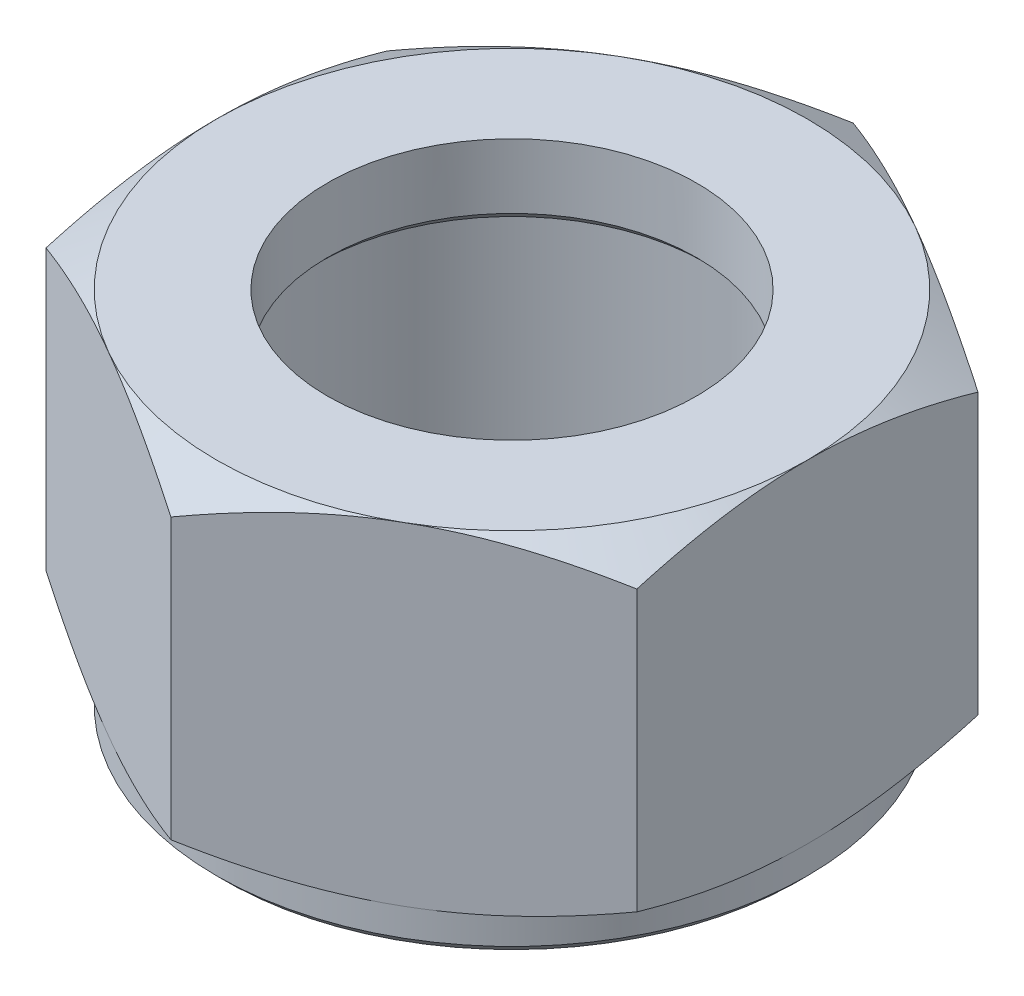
from build123d import *

# Parameters (mm, degrees)
P_IDAT_VYSUNUT_M1_DEPTH  = 18
SKICA2_OUTSIDE_W         = 106.772
SKICA2_OUTSIDE_H         = 111.722
SKICA2_OUTSIDE_R         = 16
ODEBRAT_VYSUNUT_M1_DEPTH = 18
ODEBRAT_VYSUNUT_M1_DRAFT = -60
SKICA3_OUTSIDE_W         = 106.772
SKICA3_OUTSIDE_H         = 111.722
SKICA3_OUTSIDE_R         = 16
ODEBRAT_VYSUNUT_M2_DEPTH = 18
ODEBRAT_VYSUNUT_M2_DRAFT = -60
SKICA4_R                 = 16
P_IDAT_VYSUNUT_M2_DEPTH  = 2
ZKOSEN_1_SIZE            = 0.5
SKICA5_R                 = 13
ODEBRAT_VYSUNUT_M3_DEPTH = 16
ODEBRAT_VYSUNUT_M4_REACH = 33.581
SKICA6_R                 = 10
ZKOSEN_2_SIZE            = 0.5


with BuildPart() as part:
    # Skica1 → P_idat vysunut_m1 (new body)
    with BuildSketch(Plane(origin=(0, 0, 0), x_dir=(1, 0, 0), z_dir=(0, 1, 0))):
        Polygon((0, 18.475208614), (-16, 9.237604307), (-16, -9.237604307), (0, -18.475208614), (16, -9.237604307), (16, 9.237604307), align=None)
    extrude(amount=P_IDAT_VYSUNUT_M1_DEPTH)


with BuildPart() as odebrat_vysunut_m1_tool:
    # Skica2 outside → Odebrat vysunut_m1 (with draft: the straight prism first)
    with BuildSketch(Plane(origin=(0, 18, 0), x_dir=(1, 0, 0), z_dir=(0, 1, 0))):
        Rectangle(SKICA2_OUTSIDE_W, SKICA2_OUTSIDE_H)
        Circle(SKICA2_OUTSIDE_R, mode=Mode.SUBTRACT)
    extrude(amount=-ODEBRAT_VYSUNUT_M1_DEPTH)
    # Odebrat vysunut_m1: the draft: its side faces are tilted about the plane it starts from
    odebrat_vysunut_m1_sides = [odebrat_vysunut_m1_tool.faces().sort_by_distance(p)[0] for p in [
        (0, 9, 55.861),
        (53.386, 9, 0),
        (0, 9, -55.861),
        (-53.386, 9, 0),
        (-16, 9, 0),
    ]]
    draft(odebrat_vysunut_m1_sides, Plane(origin=(0, 18, 0), x_dir=(1, 0, 0), z_dir=(0, 1, 0)), ODEBRAT_VYSUNUT_M1_DRAFT)


with BuildPart() as part_1:
    add(part.part)

    # Odebrat vysunut_m1: cut by odebrat_vysunut_m1_tool
    add(odebrat_vysunut_m1_tool.part, mode=Mode.SUBTRACT)


with BuildPart() as odebrat_vysunut_m2_tool:
    # Skica3 outside → Odebrat vysunut_m2 (with draft: the straight prism first)
    with BuildSketch(Plane.XZ):
        Rectangle(SKICA3_OUTSIDE_W, SKICA3_OUTSIDE_H)
        Circle(SKICA3_OUTSIDE_R, mode=Mode.SUBTRACT)
    extrude(amount=-ODEBRAT_VYSUNUT_M2_DEPTH)
    # Odebrat vysunut_m2: the draft: its side faces are tilted about the plane it starts from
    odebrat_vysunut_m2_sides = [odebrat_vysunut_m2_tool.faces().sort_by_distance(p)[0] for p in [
        (0, 9, -55.861),
        (53.386, 9, 0),
        (0, 9, 55.861),
        (-53.386, 9, 0),
        (-16, 9, 0),
    ]]
    draft(odebrat_vysunut_m2_sides, Plane.XZ, ODEBRAT_VYSUNUT_M2_DRAFT)


with BuildPart() as part_2:
    add(part_1.part)

    # Odebrat vysunut_m2: cut by odebrat_vysunut_m2_tool
    add(odebrat_vysunut_m2_tool.part, mode=Mode.SUBTRACT)

    # Skica4 → P_idat vysunut_m2 (add)
    with BuildSketch(Plane.XZ):
        with Locations(Location((0, 0, 0), (0, 0, 60))):
            Circle(SKICA4_R)
    extrude(amount=P_IDAT_VYSUNUT_M2_DEPTH)

    # Zkosen_1
    zkosen_1_edges = [part_2.edges().sort_by_distance(p)[0] for p in [
        (-8, -2, -13.856406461),
    ]]
    chamfer(zkosen_1_edges, length=ZKOSEN_1_SIZE)

    # Skica5 → Odebrat vysunut_m3 (cut)
    with BuildSketch(Plane.XZ.offset(2)):
        with Locations(Location((0, 0, 0), (0, 0, 270))):
            Circle(SKICA5_R)
    extrude(amount=-ODEBRAT_VYSUNUT_M3_DEPTH, mode=Mode.SUBTRACT)

    # Skica6 → Odebrat vysunut_m4 (cut, up to next)
    with BuildSketch(Plane(origin=(0, 18, 0), x_dir=(1, 0, 0), z_dir=(0, 1, 0)), mode=Mode.PRIVATE) as odebrat_vysunut_m4_sk1:
        with Locations(Location((0, 0, 0), (0, 0, 270))):
            Circle(SKICA6_R)
    odebrat_vysunut_m4_tool1 = extrude(odebrat_vysunut_m4_sk1.sketch, amount=-ODEBRAT_VYSUNUT_M4_REACH, mode=Mode.PRIVATE) & part_2.part
    add(odebrat_vysunut_m4_tool1.solids().sort_by_distance((0, 18, 0))[0], mode=Mode.SUBTRACT)

    # Zkosen_2
    zkosen_2_edges = [part_2.edges().sort_by_distance(p)[0] for p in [
        (0, 14, -10),
    ]]
    chamfer(zkosen_2_edges, length=ZKOSEN_2_SIZE)


solid = part_2.part
